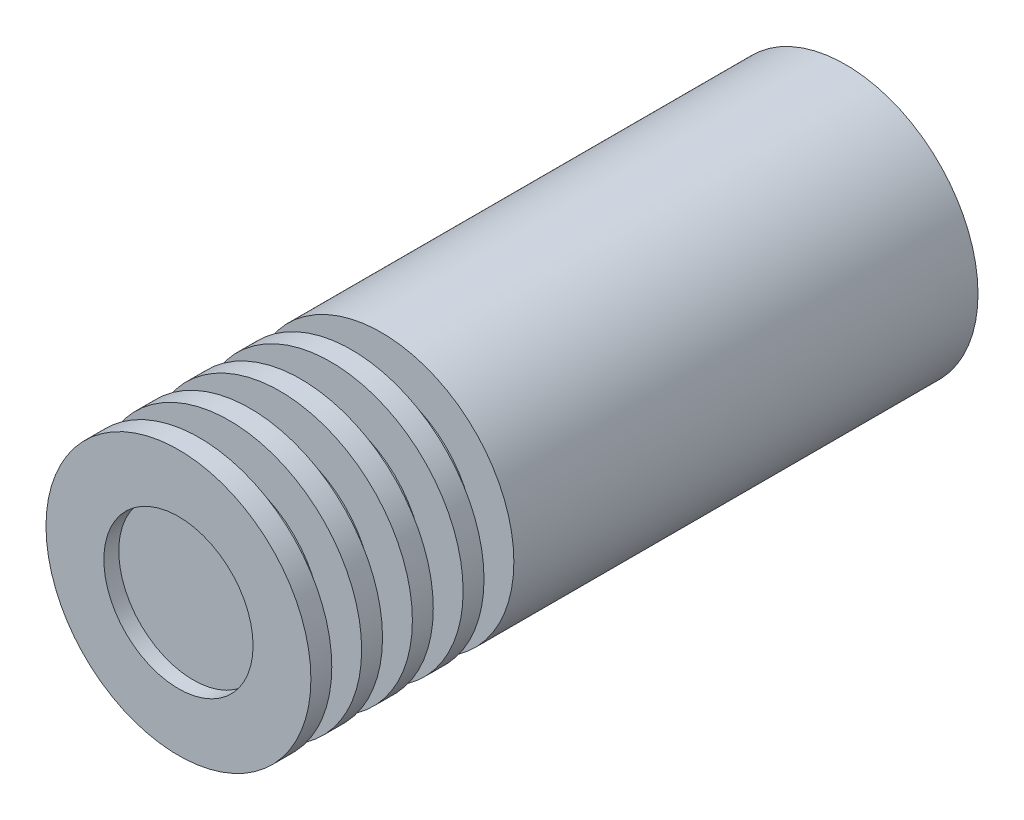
ISO-10303-21;
HEADER;
FILE_DESCRIPTION(('STEP AP214'),'2;1');
FILE_NAME('part.step','',(''),(''),'','','');
FILE_SCHEMA(('AUTOMOTIVE_DESIGN { 1 0 10303 214 1 1 1 1 }'));
ENDSEC;
DATA;
#1=APPLICATION_CONTEXT('core data for automotive mechanical design processes');
#2=APPLICATION_PROTOCOL_DEFINITION('international standard','automotive_design',2000,#1);
#3=PRODUCT_CONTEXT('',#1,'mechanical');
#4=PRODUCT('Part','Part','',(#3));
#5=PRODUCT_RELATED_PRODUCT_CATEGORY('part','',(#4));
#6=PRODUCT_DEFINITION_FORMATION('','',#4);
#7=PRODUCT_DEFINITION_CONTEXT('part definition',#1,'design');
#8=PRODUCT_DEFINITION('design','',#6,#7);
#9=PRODUCT_DEFINITION_SHAPE('','',#8);
#10=(LENGTH_UNIT() NAMED_UNIT(*) SI_UNIT(.MILLI.,.METRE.));
#11=(NAMED_UNIT(*) PLANE_ANGLE_UNIT() SI_UNIT($,.RADIAN.));
#12=(NAMED_UNIT(*) SI_UNIT($,.STERADIAN.) SOLID_ANGLE_UNIT());
#13=UNCERTAINTY_MEASURE_WITH_UNIT(LENGTH_MEASURE(1.E-05),#10,'distance_accuracy_value','');
#14=(GEOMETRIC_REPRESENTATION_CONTEXT(3) GLOBAL_UNCERTAINTY_ASSIGNED_CONTEXT((#13)) GLOBAL_UNIT_ASSIGNED_CONTEXT((#10,
#11,#12)) REPRESENTATION_CONTEXT('',''));
#15=CARTESIAN_POINT('',(0.,0.,0.));
#16=DIRECTION('',(0.,0.,1.));
#17=DIRECTION('',(1.,0.,0.));
#18=AXIS2_PLACEMENT_3D('',#15,#16,#17);
#19=CARTESIAN_POINT('',(0.,0.,44.7));
#20=DIRECTION('',(0.,0.,-1.));
#21=DIRECTION('',(-1.,0.,0.));
#22=AXIS2_PLACEMENT_3D('',#19,#20,#21);
#23=CYLINDRICAL_SURFACE('',#22,8.875);
#24=CARTESIAN_POINT('',(0.,0.,44.7));
#25=DIRECTION('',(0.,0.,1.));
#26=DIRECTION('',(1.,0.,0.));
#27=AXIS2_PLACEMENT_3D('',#24,#25,#26);
#28=CIRCLE('',#27,8.875);
#29=CARTESIAN_POINT('',(-8.875,0.,44.7));
#30=VERTEX_POINT('',#29);
#31=EDGE_CURVE('E10',#30,#30,#28,.T.);
#32=CARTESIAN_POINT('',(0.,0.,43.3));
#33=DIRECTION('',(0.,0.,1.));
#34=DIRECTION('',(1.,0.,0.));
#35=AXIS2_PLACEMENT_3D('',#32,#33,#34);
#36=CIRCLE('',#35,8.875);
#37=CARTESIAN_POINT('',(-8.875,0.,43.3));
#38=VERTEX_POINT('',#37);
#39=EDGE_CURVE('E89',#38,#38,#36,.T.);
#40=CARTESIAN_POINT('',(-8.875,0.,44.7));
#41=CARTESIAN_POINT('',(-8.875,0.,44.6854166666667));
#42=CARTESIAN_POINT('',(-8.875,0.,44.6708333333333));
#43=CARTESIAN_POINT('',(-8.875,0.,44.6416666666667));
#44=CARTESIAN_POINT('',(-8.875,0.,44.6270833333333));
#45=CARTESIAN_POINT('',(-8.875,0.,44.5979166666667));
#46=CARTESIAN_POINT('',(-8.875,0.,44.5833333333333));
#47=CARTESIAN_POINT('',(-8.875,0.,44.5541666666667));
#48=CARTESIAN_POINT('',(-8.875,0.,44.5395833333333));
#49=CARTESIAN_POINT('',(-8.875,0.,44.5104166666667));
#50=CARTESIAN_POINT('',(-8.875,0.,44.4958333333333));
#51=CARTESIAN_POINT('',(-8.875,0.,44.4666666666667));
#52=CARTESIAN_POINT('',(-8.875,0.,44.4520833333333));
#53=CARTESIAN_POINT('',(-8.875,0.,44.4229166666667));
#54=CARTESIAN_POINT('',(-8.875,0.,44.4083333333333));
#55=CARTESIAN_POINT('',(-8.875,0.,44.3791666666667));
#56=CARTESIAN_POINT('',(-8.875,0.,44.3645833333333));
#57=CARTESIAN_POINT('',(-8.875,0.,44.3354166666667));
#58=CARTESIAN_POINT('',(-8.875,0.,44.3208333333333));
#59=CARTESIAN_POINT('',(-8.875,0.,44.2916666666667));
#60=CARTESIAN_POINT('',(-8.875,0.,44.2770833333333));
#61=CARTESIAN_POINT('',(-8.875,0.,44.2479166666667));
#62=CARTESIAN_POINT('',(-8.875,0.,44.2333333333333));
#63=CARTESIAN_POINT('',(-8.875,0.,44.2041666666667));
#64=CARTESIAN_POINT('',(-8.875,0.,44.1895833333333));
#65=CARTESIAN_POINT('',(-8.875,0.,44.1604166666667));
#66=CARTESIAN_POINT('',(-8.875,0.,44.1458333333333));
#67=CARTESIAN_POINT('',(-8.875,0.,44.1166666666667));
#68=CARTESIAN_POINT('',(-8.875,0.,44.1020833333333));
#69=CARTESIAN_POINT('',(-8.875,0.,44.0729166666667));
#70=CARTESIAN_POINT('',(-8.875,0.,44.0583333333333));
#71=CARTESIAN_POINT('',(-8.875,0.,44.0291666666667));
#72=CARTESIAN_POINT('',(-8.875,0.,44.0145833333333));
#73=CARTESIAN_POINT('',(-8.875,0.,43.9854166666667));
#74=CARTESIAN_POINT('',(-8.875,0.,43.9708333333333));
#75=CARTESIAN_POINT('',(-8.875,0.,43.9416666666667));
#76=CARTESIAN_POINT('',(-8.875,0.,43.9270833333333));
#77=CARTESIAN_POINT('',(-8.875,0.,43.8979166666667));
#78=CARTESIAN_POINT('',(-8.875,0.,43.8833333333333));
#79=CARTESIAN_POINT('',(-8.875,0.,43.8541666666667));
#80=CARTESIAN_POINT('',(-8.875,0.,43.8395833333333));
#81=CARTESIAN_POINT('',(-8.875,0.,43.8104166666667));
#82=CARTESIAN_POINT('',(-8.875,0.,43.7958333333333));
#83=CARTESIAN_POINT('',(-8.875,0.,43.7666666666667));
#84=CARTESIAN_POINT('',(-8.875,0.,43.7520833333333));
#85=CARTESIAN_POINT('',(-8.875,0.,43.7229166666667));
#86=CARTESIAN_POINT('',(-8.875,0.,43.7083333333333));
#87=CARTESIAN_POINT('',(-8.875,0.,43.6791666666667));
#88=CARTESIAN_POINT('',(-8.875,0.,43.6645833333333));
#89=CARTESIAN_POINT('',(-8.875,0.,43.6354166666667));
#90=CARTESIAN_POINT('',(-8.875,0.,43.6208333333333));
#91=CARTESIAN_POINT('',(-8.875,0.,43.5916666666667));
#92=CARTESIAN_POINT('',(-8.875,0.,43.5770833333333));
#93=CARTESIAN_POINT('',(-8.875,0.,43.5479166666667));
#94=CARTESIAN_POINT('',(-8.875,0.,43.5333333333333));
#95=CARTESIAN_POINT('',(-8.875,0.,43.5041666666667));
#96=CARTESIAN_POINT('',(-8.875,0.,43.4895833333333));
#97=CARTESIAN_POINT('',(-8.875,0.,43.4604166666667));
#98=CARTESIAN_POINT('',(-8.875,0.,43.4458333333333));
#99=CARTESIAN_POINT('',(-8.875,0.,43.4166666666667));
#100=CARTESIAN_POINT('',(-8.875,0.,43.4020833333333));
#101=CARTESIAN_POINT('',(-8.875,0.,43.3729166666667));
#102=CARTESIAN_POINT('',(-8.875,0.,43.3583333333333));
#103=CARTESIAN_POINT('',(-8.875,0.,43.3291666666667));
#104=CARTESIAN_POINT('',(-8.875,0.,43.3145833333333));
#105=CARTESIAN_POINT('',(-8.875,0.,43.3));
#106=B_SPLINE_CURVE_WITH_KNOTS('',3,(#40,#41,#42,#43,#44,#45,#46,#47,#48,#49,#50,#51,#52,#53,
#54,#55,#56,#57,#58,#59,#60,#61,#62,#63,#64,#65,#66,#67,#68,#69,#70,#71,#72,#73,#74,#75,#76,#77,
#78,#79,#80,#81,#82,#83,#84,#85,#86,#87,#88,#89,#90,#91,#92,#93,#94,#95,#96,#97,#98,#99,#100,
#101,#102,#103,#104,#105),.UNSPECIFIED.,.F.,.F.,(4,2,2,2,2,2,2,2,2,2,2,2,2,2,2,2,2,2,2,2,2,2,2,
2,2,2,2,2,2,2,2,2,4),(0.,0.0437500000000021,0.0875000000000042,0.131250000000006,
0.175000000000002,0.218750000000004,0.262500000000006,0.306250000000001,0.350000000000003,
0.393750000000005,0.4375,0.481250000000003,0.525000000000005,0.56875,0.612500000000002,
0.656250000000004,0.700000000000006,0.743750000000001,0.787500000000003,0.831250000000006,
0.875000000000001,0.918750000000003,0.962500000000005,1.00625,1.05,1.09375,1.1375,1.18125,1.225,
1.26875,1.3125,1.35625,1.40000000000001),.UNSPECIFIED.);
#107=EDGE_CURVE('BSEAM37',#30,#38,#106,.T.);
#108=ORIENTED_EDGE('',*,*,#31,.F.);
#109=ORIENTED_EDGE('',*,*,#39,.T.);
#110=ORIENTED_EDGE('',*,*,#107,.T.);
#111=ORIENTED_EDGE('',*,*,#107,.F.);
#112=EDGE_LOOP('',(#108,#110,#109,#111));
#113=FACE_BOUND('',#112,.T.);
#114=ADVANCED_FACE('F37',(#113),#23,.T.);
#115=CARTESIAN_POINT('',(0.,0.,44.7));
#116=DIRECTION('',(0.,0.,1.));
#117=DIRECTION('',(1.,0.,0.));
#118=AXIS2_PLACEMENT_3D('',#115,#116,#117);
#119=PLANE('',#118);
#120=CARTESIAN_POINT('',(0.,0.,44.7));
#121=DIRECTION('',(0.,0.,1.));
#122=DIRECTION('',(1.,0.,0.));
#123=AXIS2_PLACEMENT_3D('',#120,#121,#122);
#124=CIRCLE('',#123,5.);
#125=CARTESIAN_POINT('',(5.,0.,44.7));
#126=VERTEX_POINT('',#125);
#127=EDGE_CURVE('E115',#126,#126,#124,.T.);
#128=ORIENTED_EDGE('',*,*,#127,.F.);
#129=EDGE_LOOP('',(#128));
#130=FACE_BOUND('',#129,.T.);
#131=ORIENTED_EDGE('',*,*,#31,.T.);
#132=EDGE_LOOP('',(#131));
#133=FACE_BOUND('',#132,.T.);
#134=ADVANCED_FACE('F132',(#130,#133),#119,.T.);
#135=CARTESIAN_POINT('',(0.,8.875,43.3));
#136=DIRECTION('',(0.,0.,-1.));
#137=DIRECTION('',(-1.,0.,0.));
#138=AXIS2_PLACEMENT_3D('',#135,#136,#137);
#139=PLANE('',#138);
#140=CARTESIAN_POINT('',(0.,0.,43.3));
#141=DIRECTION('',(0.,0.,1.));
#142=DIRECTION('',(1.,0.,0.));
#143=AXIS2_PLACEMENT_3D('',#140,#141,#142);
#144=CIRCLE('',#143,6.175);
#145=CARTESIAN_POINT('',(6.175,0.,43.3));
#146=VERTEX_POINT('',#145);
#147=EDGE_CURVE('E49',#146,#146,#144,.T.);
#148=ORIENTED_EDGE('',*,*,#147,.T.);
#149=EDGE_LOOP('',(#148));
#150=FACE_BOUND('',#149,.T.);
#151=ORIENTED_EDGE('',*,*,#39,.F.);
#152=EDGE_LOOP('',(#151));
#153=FACE_BOUND('',#152,.T.);
#154=ADVANCED_FACE('F134',(#150,#153),#139,.T.);
#155=CARTESIAN_POINT('',(0.,0.,44.7));
#156=DIRECTION('',(0.,0.,1.));
#157=DIRECTION('',(1.,0.,0.));
#158=AXIS2_PLACEMENT_3D('',#155,#156,#157);
#159=CYLINDRICAL_SURFACE('',#158,6.175);
#160=CARTESIAN_POINT('',(0.,0.,41.3));
#161=DIRECTION('',(0.,0.,1.));
#162=DIRECTION('',(1.,0.,0.));
#163=AXIS2_PLACEMENT_3D('',#160,#161,#162);
#164=CIRCLE('',#163,6.175);
#165=CARTESIAN_POINT('',(6.175,0.,41.3));
#166=VERTEX_POINT('',#165);
#167=EDGE_CURVE('E104',#166,#166,#164,.T.);
#168=ORIENTED_EDGE('',*,*,#167,.T.);
#169=EDGE_LOOP('',(#168));
#170=FACE_BOUND('',#169,.T.);
#171=ORIENTED_EDGE('',*,*,#147,.F.);
#172=EDGE_LOOP('',(#171));
#173=FACE_BOUND('',#172,.T.);
#174=ADVANCED_FACE('F140',(#170,#173),#159,.T.);
#175=CARTESIAN_POINT('',(0.,8.875,41.3));
#176=DIRECTION('',(0.,0.,1.));
#177=DIRECTION('',(1.,0.,0.));
#178=AXIS2_PLACEMENT_3D('',#175,#176,#177);
#179=PLANE('',#178);
#180=CARTESIAN_POINT('',(0.,0.,41.3));
#181=DIRECTION('',(0.,0.,1.));
#182=DIRECTION('',(1.,0.,0.));
#183=AXIS2_PLACEMENT_3D('',#180,#181,#182);
#184=CIRCLE('',#183,8.875);
#185=CARTESIAN_POINT('',(-8.875,0.,41.3));
#186=VERTEX_POINT('',#185);
#187=EDGE_CURVE('E108',#186,#186,#184,.T.);
#188=ORIENTED_EDGE('',*,*,#187,.T.);
#189=EDGE_LOOP('',(#188));
#190=FACE_BOUND('',#189,.T.);
#191=ORIENTED_EDGE('',*,*,#167,.F.);
#192=EDGE_LOOP('',(#191));
#193=FACE_BOUND('',#192,.T.);
#194=ADVANCED_FACE('F222',(#190,#193),#179,.T.);
#195=CARTESIAN_POINT('',(0.,0.,39.9));
#196=DIRECTION('',(0.,0.,1.));
#197=DIRECTION('',(1.,0.,0.));
#198=AXIS2_PLACEMENT_3D('',#195,#196,#197);
#199=CIRCLE('',#198,8.875);
#200=CARTESIAN_POINT('',(-8.875,0.,39.9));
#201=VERTEX_POINT('',#200);
#202=EDGE_CURVE('E73',#201,#201,#199,.T.);
#203=CARTESIAN_POINT('',(-8.875,0.,39.9));
#204=CARTESIAN_POINT('',(-8.875,0.,39.9145833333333));
#205=CARTESIAN_POINT('',(-8.875,0.,39.9291666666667));
#206=CARTESIAN_POINT('',(-8.875,0.,39.9583333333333));
#207=CARTESIAN_POINT('',(-8.875,0.,39.9729166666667));
#208=CARTESIAN_POINT('',(-8.875,0.,40.0020833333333));
#209=CARTESIAN_POINT('',(-8.875,0.,40.0166666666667));
#210=CARTESIAN_POINT('',(-8.875,0.,40.0458333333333));
#211=CARTESIAN_POINT('',(-8.875,0.,40.0604166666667));
#212=CARTESIAN_POINT('',(-8.875,0.,40.0895833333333));
#213=CARTESIAN_POINT('',(-8.875,0.,40.1041666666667));
#214=CARTESIAN_POINT('',(-8.875,0.,40.1333333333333));
#215=CARTESIAN_POINT('',(-8.875,0.,40.1479166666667));
#216=CARTESIAN_POINT('',(-8.875,0.,40.1770833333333));
#217=CARTESIAN_POINT('',(-8.875,0.,40.1916666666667));
#218=CARTESIAN_POINT('',(-8.875,0.,40.2208333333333));
#219=CARTESIAN_POINT('',(-8.875,0.,40.2354166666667));
#220=CARTESIAN_POINT('',(-8.875,0.,40.2645833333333));
#221=CARTESIAN_POINT('',(-8.875,0.,40.2791666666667));
#222=CARTESIAN_POINT('',(-8.875,0.,40.3083333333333));
#223=CARTESIAN_POINT('',(-8.875,0.,40.3229166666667));
#224=CARTESIAN_POINT('',(-8.875,0.,40.3520833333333));
#225=CARTESIAN_POINT('',(-8.875,0.,40.3666666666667));
#226=CARTESIAN_POINT('',(-8.875,0.,40.3958333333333));
#227=CARTESIAN_POINT('',(-8.875,0.,40.4104166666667));
#228=CARTESIAN_POINT('',(-8.875,0.,40.4395833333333));
#229=CARTESIAN_POINT('',(-8.875,0.,40.4541666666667));
#230=CARTESIAN_POINT('',(-8.875,0.,40.4833333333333));
#231=CARTESIAN_POINT('',(-8.875,0.,40.4979166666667));
#232=CARTESIAN_POINT('',(-8.875,0.,40.5270833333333));
#233=CARTESIAN_POINT('',(-8.875,0.,40.5416666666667));
#234=CARTESIAN_POINT('',(-8.875,0.,40.5708333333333));
#235=CARTESIAN_POINT('',(-8.875,0.,40.5854166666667));
#236=CARTESIAN_POINT('',(-8.875,0.,40.6145833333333));
#237=CARTESIAN_POINT('',(-8.875,0.,40.6291666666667));
#238=CARTESIAN_POINT('',(-8.875,0.,40.6583333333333));
#239=CARTESIAN_POINT('',(-8.875,0.,40.6729166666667));
#240=CARTESIAN_POINT('',(-8.875,0.,40.7020833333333));
#241=CARTESIAN_POINT('',(-8.875,0.,40.7166666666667));
#242=CARTESIAN_POINT('',(-8.875,0.,40.7458333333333));
#243=CARTESIAN_POINT('',(-8.875,0.,40.7604166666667));
#244=CARTESIAN_POINT('',(-8.875,0.,40.7895833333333));
#245=CARTESIAN_POINT('',(-8.875,0.,40.8041666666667));
#246=CARTESIAN_POINT('',(-8.875,0.,40.8333333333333));
#247=CARTESIAN_POINT('',(-8.875,0.,40.8479166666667));
#248=CARTESIAN_POINT('',(-8.875,0.,40.8770833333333));
#249=CARTESIAN_POINT('',(-8.875,0.,40.8916666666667));
#250=CARTESIAN_POINT('',(-8.875,0.,40.9208333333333));
#251=CARTESIAN_POINT('',(-8.875,0.,40.9354166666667));
#252=CARTESIAN_POINT('',(-8.875,0.,40.9645833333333));
#253=CARTESIAN_POINT('',(-8.875,0.,40.9791666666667));
#254=CARTESIAN_POINT('',(-8.875,0.,41.0083333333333));
#255=CARTESIAN_POINT('',(-8.875,0.,41.0229166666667));
#256=CARTESIAN_POINT('',(-8.875,0.,41.0520833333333));
#257=CARTESIAN_POINT('',(-8.875,0.,41.0666666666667));
#258=CARTESIAN_POINT('',(-8.875,0.,41.0958333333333));
#259=CARTESIAN_POINT('',(-8.875,0.,41.1104166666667));
#260=CARTESIAN_POINT('',(-8.875,0.,41.1395833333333));
#261=CARTESIAN_POINT('',(-8.875,0.,41.1541666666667));
#262=CARTESIAN_POINT('',(-8.875,0.,41.1833333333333));
#263=CARTESIAN_POINT('',(-8.875,0.,41.1979166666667));
#264=CARTESIAN_POINT('',(-8.875,0.,41.2270833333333));
#265=CARTESIAN_POINT('',(-8.875,0.,41.2416666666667));
#266=CARTESIAN_POINT('',(-8.875,0.,41.2708333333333));
#267=CARTESIAN_POINT('',(-8.875,0.,41.2854166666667));
#268=CARTESIAN_POINT('',(-8.875,0.,41.3));
#269=B_SPLINE_CURVE_WITH_KNOTS('',3,(#203,#204,#205,#206,#207,#208,#209,#210,#211,#212,#213,
#214,#215,#216,#217,#218,#219,#220,#221,#222,#223,#224,#225,#226,#227,#228,#229,#230,#231,#232,
#233,#234,#235,#236,#237,#238,#239,#240,#241,#242,#243,#244,#245,#246,#247,#248,#249,#250,#251,
#252,#253,#254,#255,#256,#257,#258,#259,#260,#261,#262,#263,#264,#265,#266,#267,#268),
.UNSPECIFIED.,.F.,.F.,(4,2,2,2,2,2,2,2,2,2,2,2,2,2,2,2,2,2,2,2,2,2,2,2,2,2,2,2,2,2,2,2,4),(0.,
0.0437500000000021,0.0875000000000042,0.131250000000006,0.175000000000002,0.218750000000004,
0.262500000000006,0.306250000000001,0.350000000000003,0.393750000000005,0.4375,
0.481250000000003,0.525000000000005,0.56875,0.612500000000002,0.656250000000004,
0.699999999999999,0.743750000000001,0.787500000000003,0.831249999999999,0.875000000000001,
0.918750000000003,0.962500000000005,1.00625,1.05,1.09375,1.1375,1.18125,1.225,1.26875,1.3125,
1.35625,1.4),.UNSPECIFIED.);
#270=EDGE_CURVE('BSEAM144',#201,#186,#269,.T.);
#271=ORIENTED_EDGE('',*,*,#202,.T.);
#272=ORIENTED_EDGE('',*,*,#187,.F.);
#273=ORIENTED_EDGE('',*,*,#270,.T.);
#274=ORIENTED_EDGE('',*,*,#270,.F.);
#275=EDGE_LOOP('',(#271,#273,#272,#274));
#276=FACE_BOUND('',#275,.T.);
#277=ADVANCED_FACE('F144',(#276),#23,.T.);
#278=CARTESIAN_POINT('',(0.,8.875,39.9));
#279=DIRECTION('',(0.,0.,-1.));
#280=DIRECTION('',(-1.,0.,0.));
#281=AXIS2_PLACEMENT_3D('',#278,#279,#280);
#282=PLANE('',#281);
#283=CARTESIAN_POINT('',(0.,0.,39.9));
#284=DIRECTION('',(0.,0.,1.));
#285=DIRECTION('',(1.,0.,0.));
#286=AXIS2_PLACEMENT_3D('',#283,#284,#285);
#287=CIRCLE('',#286,6.175);
#288=CARTESIAN_POINT('',(6.175,0.,39.9));
#289=VERTEX_POINT('',#288);
#290=EDGE_CURVE('E85',#289,#289,#287,.T.);
#291=ORIENTED_EDGE('',*,*,#290,.T.);
#292=EDGE_LOOP('',(#291));
#293=FACE_BOUND('',#292,.T.);
#294=ORIENTED_EDGE('',*,*,#202,.F.);
#295=EDGE_LOOP('',(#294));
#296=FACE_BOUND('',#295,.T.);
#297=ADVANCED_FACE('F211',(#293,#296),#282,.T.);
#298=CARTESIAN_POINT('',(0.,0.,44.7));
#299=DIRECTION('',(0.,0.,1.));
#300=DIRECTION('',(1.,0.,0.));
#301=AXIS2_PLACEMENT_3D('',#298,#299,#300);
#302=CYLINDRICAL_SURFACE('',#301,6.175);
#303=CARTESIAN_POINT('',(0.,0.,37.9));
#304=DIRECTION('',(0.,0.,1.));
#305=DIRECTION('',(1.,0.,0.));
#306=AXIS2_PLACEMENT_3D('',#303,#304,#305);
#307=CIRCLE('',#306,6.175);
#308=CARTESIAN_POINT('',(6.175,0.,37.9));
#309=VERTEX_POINT('',#308);
#310=EDGE_CURVE('E90',#309,#309,#307,.T.);
#311=ORIENTED_EDGE('',*,*,#310,.T.);
#312=EDGE_LOOP('',(#311));
#313=FACE_BOUND('',#312,.T.);
#314=ORIENTED_EDGE('',*,*,#290,.F.);
#315=EDGE_LOOP('',(#314));
#316=FACE_BOUND('',#315,.T.);
#317=ADVANCED_FACE('F205',(#313,#316),#302,.T.);
#318=CARTESIAN_POINT('',(0.,8.875,37.9));
#319=DIRECTION('',(0.,0.,1.));
#320=DIRECTION('',(1.,0.,0.));
#321=AXIS2_PLACEMENT_3D('',#318,#319,#320);
#322=PLANE('',#321);
#323=CARTESIAN_POINT('',(0.,0.,37.9));
#324=DIRECTION('',(0.,0.,1.));
#325=DIRECTION('',(1.,0.,0.));
#326=AXIS2_PLACEMENT_3D('',#323,#324,#325);
#327=CIRCLE('',#326,8.875);
#328=CARTESIAN_POINT('',(-8.875,0.,37.9));
#329=VERTEX_POINT('',#328);
#330=EDGE_CURVE('E94',#329,#329,#327,.T.);
#331=ORIENTED_EDGE('',*,*,#330,.T.);
#332=EDGE_LOOP('',(#331));
#333=FACE_BOUND('',#332,.T.);
#334=ORIENTED_EDGE('',*,*,#310,.F.);
#335=EDGE_LOOP('',(#334));
#336=FACE_BOUND('',#335,.T.);
#337=ADVANCED_FACE('F200',(#333,#336),#322,.T.);
#338=CARTESIAN_POINT('',(0.,0.,36.5));
#339=DIRECTION('',(0.,0.,1.));
#340=DIRECTION('',(1.,0.,0.));
#341=AXIS2_PLACEMENT_3D('',#338,#339,#340);
#342=CIRCLE('',#341,8.87499999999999);
#343=CARTESIAN_POINT('',(-8.875,0.,36.5));
#344=VERTEX_POINT('',#343);
#345=EDGE_CURVE('E55',#344,#344,#342,.T.);
#346=CARTESIAN_POINT('',(-8.875,0.,36.5));
#347=CARTESIAN_POINT('',(-8.875,0.,36.5145833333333));
#348=CARTESIAN_POINT('',(-8.875,0.,36.5291666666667));
#349=CARTESIAN_POINT('',(-8.875,0.,36.5583333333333));
#350=CARTESIAN_POINT('',(-8.875,0.,36.5729166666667));
#351=CARTESIAN_POINT('',(-8.875,0.,36.6020833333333));
#352=CARTESIAN_POINT('',(-8.875,0.,36.6166666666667));
#353=CARTESIAN_POINT('',(-8.875,0.,36.6458333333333));
#354=CARTESIAN_POINT('',(-8.875,0.,36.6604166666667));
#355=CARTESIAN_POINT('',(-8.875,0.,36.6895833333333));
#356=CARTESIAN_POINT('',(-8.875,0.,36.7041666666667));
#357=CARTESIAN_POINT('',(-8.875,0.,36.7333333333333));
#358=CARTESIAN_POINT('',(-8.875,0.,36.7479166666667));
#359=CARTESIAN_POINT('',(-8.875,0.,36.7770833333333));
#360=CARTESIAN_POINT('',(-8.875,0.,36.7916666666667));
#361=CARTESIAN_POINT('',(-8.875,0.,36.8208333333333));
#362=CARTESIAN_POINT('',(-8.875,0.,36.8354166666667));
#363=CARTESIAN_POINT('',(-8.875,0.,36.8645833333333));
#364=CARTESIAN_POINT('',(-8.875,0.,36.8791666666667));
#365=CARTESIAN_POINT('',(-8.875,0.,36.9083333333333));
#366=CARTESIAN_POINT('',(-8.875,0.,36.9229166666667));
#367=CARTESIAN_POINT('',(-8.875,0.,36.9520833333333));
#368=CARTESIAN_POINT('',(-8.875,0.,36.9666666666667));
#369=CARTESIAN_POINT('',(-8.875,0.,36.9958333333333));
#370=CARTESIAN_POINT('',(-8.875,0.,37.0104166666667));
#371=CARTESIAN_POINT('',(-8.875,0.,37.0395833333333));
#372=CARTESIAN_POINT('',(-8.875,0.,37.0541666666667));
#373=CARTESIAN_POINT('',(-8.875,0.,37.0833333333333));
#374=CARTESIAN_POINT('',(-8.875,0.,37.0979166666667));
#375=CARTESIAN_POINT('',(-8.875,0.,37.1270833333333));
#376=CARTESIAN_POINT('',(-8.875,0.,37.1416666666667));
#377=CARTESIAN_POINT('',(-8.875,0.,37.1708333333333));
#378=CARTESIAN_POINT('',(-8.875,0.,37.1854166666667));
#379=CARTESIAN_POINT('',(-8.875,0.,37.2145833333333));
#380=CARTESIAN_POINT('',(-8.875,0.,37.2291666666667));
#381=CARTESIAN_POINT('',(-8.875,0.,37.2583333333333));
#382=CARTESIAN_POINT('',(-8.875,0.,37.2729166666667));
#383=CARTESIAN_POINT('',(-8.875,0.,37.3020833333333));
#384=CARTESIAN_POINT('',(-8.875,0.,37.3166666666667));
#385=CARTESIAN_POINT('',(-8.875,0.,37.3458333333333));
#386=CARTESIAN_POINT('',(-8.875,0.,37.3604166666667));
#387=CARTESIAN_POINT('',(-8.875,0.,37.3895833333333));
#388=CARTESIAN_POINT('',(-8.875,0.,37.4041666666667));
#389=CARTESIAN_POINT('',(-8.875,0.,37.4333333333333));
#390=CARTESIAN_POINT('',(-8.875,0.,37.4479166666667));
#391=CARTESIAN_POINT('',(-8.875,0.,37.4770833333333));
#392=CARTESIAN_POINT('',(-8.875,0.,37.4916666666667));
#393=CARTESIAN_POINT('',(-8.875,0.,37.5208333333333));
#394=CARTESIAN_POINT('',(-8.875,0.,37.5354166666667));
#395=CARTESIAN_POINT('',(-8.875,0.,37.5645833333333));
#396=CARTESIAN_POINT('',(-8.875,0.,37.5791666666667));
#397=CARTESIAN_POINT('',(-8.875,0.,37.6083333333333));
#398=CARTESIAN_POINT('',(-8.875,0.,37.6229166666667));
#399=CARTESIAN_POINT('',(-8.875,0.,37.6520833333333));
#400=CARTESIAN_POINT('',(-8.875,0.,37.6666666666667));
#401=CARTESIAN_POINT('',(-8.875,0.,37.6958333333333));
#402=CARTESIAN_POINT('',(-8.875,0.,37.7104166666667));
#403=CARTESIAN_POINT('',(-8.875,0.,37.7395833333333));
#404=CARTESIAN_POINT('',(-8.875,0.,37.7541666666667));
#405=CARTESIAN_POINT('',(-8.875,0.,37.7833333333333));
#406=CARTESIAN_POINT('',(-8.875,0.,37.7979166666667));
#407=CARTESIAN_POINT('',(-8.875,0.,37.8270833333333));
#408=CARTESIAN_POINT('',(-8.875,0.,37.8416666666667));
#409=CARTESIAN_POINT('',(-8.875,0.,37.8708333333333));
#410=CARTESIAN_POINT('',(-8.875,0.,37.8854166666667));
#411=CARTESIAN_POINT('',(-8.875,0.,37.9));
#412=B_SPLINE_CURVE_WITH_KNOTS('',3,(#346,#347,#348,#349,#350,#351,#352,#353,#354,#355,#356,
#357,#358,#359,#360,#361,#362,#363,#364,#365,#366,#367,#368,#369,#370,#371,#372,#373,#374,#375,
#376,#377,#378,#379,#380,#381,#382,#383,#384,#385,#386,#387,#388,#389,#390,#391,#392,#393,#394,
#395,#396,#397,#398,#399,#400,#401,#402,#403,#404,#405,#406,#407,#408,#409,#410,#411),
.UNSPECIFIED.,.F.,.F.,(4,2,2,2,2,2,2,2,2,2,2,2,2,2,2,2,2,2,2,2,2,2,2,2,2,2,2,2,2,2,2,2,4),(0.,
0.0437500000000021,0.0875000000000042,0.131249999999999,0.175000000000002,0.218750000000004,
0.262500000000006,0.306250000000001,0.350000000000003,0.393749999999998,0.4375,
0.481250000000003,0.525000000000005,0.56875,0.612500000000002,0.656250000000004,
0.699999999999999,0.743750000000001,0.787500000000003,0.831249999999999,0.875000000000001,
0.918750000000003,0.962499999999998,1.00625,1.05,1.09375,1.1375,1.18125,1.225,1.26875,1.3125,
1.35625,1.4),.UNSPECIFIED.);
#413=EDGE_CURVE('BSEAM178',#344,#329,#412,.T.);
#414=ORIENTED_EDGE('',*,*,#345,.T.);
#415=ORIENTED_EDGE('',*,*,#330,.F.);
#416=ORIENTED_EDGE('',*,*,#413,.T.);
#417=ORIENTED_EDGE('',*,*,#413,.F.);
#418=EDGE_LOOP('',(#414,#416,#415,#417));
#419=FACE_BOUND('',#418,.T.);
#420=ADVANCED_FACE('F178',(#419),#23,.T.);
#421=CARTESIAN_POINT('',(0.,8.87499999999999,36.5));
#422=DIRECTION('',(0.,0.,-1.));
#423=DIRECTION('',(-1.,0.,0.));
#424=AXIS2_PLACEMENT_3D('',#421,#422,#423);
#425=PLANE('',#424);
#426=CARTESIAN_POINT('',(0.,0.,36.5));
#427=DIRECTION('',(0.,0.,1.));
#428=DIRECTION('',(1.,0.,0.));
#429=AXIS2_PLACEMENT_3D('',#426,#427,#428);
#430=CIRCLE('',#429,6.175);
#431=CARTESIAN_POINT('',(6.175,0.,36.5));
#432=VERTEX_POINT('',#431);
#433=EDGE_CURVE('E69',#432,#432,#430,.T.);
#434=ORIENTED_EDGE('',*,*,#433,.T.);
#435=EDGE_LOOP('',(#434));
#436=FACE_BOUND('',#435,.T.);
#437=ORIENTED_EDGE('',*,*,#345,.F.);
#438=EDGE_LOOP('',(#437));
#439=FACE_BOUND('',#438,.T.);
#440=ADVANCED_FACE('F189',(#436,#439),#425,.T.);
#441=CARTESIAN_POINT('',(0.,0.,44.7));
#442=DIRECTION('',(0.,0.,1.));
#443=DIRECTION('',(1.,0.,0.));
#444=AXIS2_PLACEMENT_3D('',#441,#442,#443);
#445=CYLINDRICAL_SURFACE('',#444,6.175);
#446=CARTESIAN_POINT('',(0.,0.,34.5));
#447=DIRECTION('',(0.,0.,1.));
#448=DIRECTION('',(1.,0.,0.));
#449=AXIS2_PLACEMENT_3D('',#446,#447,#448);
#450=CIRCLE('',#449,6.175);
#451=CARTESIAN_POINT('',(6.175,0.,34.5));
#452=VERTEX_POINT('',#451);
#453=EDGE_CURVE('E74',#452,#452,#450,.T.);
#454=ORIENTED_EDGE('',*,*,#453,.T.);
#455=EDGE_LOOP('',(#454));
#456=FACE_BOUND('',#455,.T.);
#457=ORIENTED_EDGE('',*,*,#433,.F.);
#458=EDGE_LOOP('',(#457));
#459=FACE_BOUND('',#458,.T.);
#460=ADVANCED_FACE('F183',(#456,#459),#445,.T.);
#461=CARTESIAN_POINT('',(0.,8.87499999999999,34.5));
#462=DIRECTION('',(0.,0.,1.));
#463=DIRECTION('',(1.,0.,0.));
#464=AXIS2_PLACEMENT_3D('',#461,#462,#463);
#465=PLANE('',#464);
#466=CARTESIAN_POINT('',(0.,0.,34.5));
#467=DIRECTION('',(0.,0.,1.));
#468=DIRECTION('',(1.,0.,0.));
#469=AXIS2_PLACEMENT_3D('',#466,#467,#468);
#470=CIRCLE('',#469,8.87499999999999);
#471=CARTESIAN_POINT('',(-8.875,0.,34.5));
#472=VERTEX_POINT('',#471);
#473=EDGE_CURVE('E78',#472,#472,#470,.T.);
#474=ORIENTED_EDGE('',*,*,#473,.T.);
#475=EDGE_LOOP('',(#474));
#476=FACE_BOUND('',#475,.T.);
#477=ORIENTED_EDGE('',*,*,#453,.F.);
#478=EDGE_LOOP('',(#477));
#479=FACE_BOUND('',#478,.T.);
#480=ADVANCED_FACE('F177',(#476,#479),#465,.T.);
#481=CARTESIAN_POINT('',(0.,0.,33.1));
#482=DIRECTION('',(0.,0.,1.));
#483=DIRECTION('',(1.,0.,0.));
#484=AXIS2_PLACEMENT_3D('',#481,#482,#483);
#485=CIRCLE('',#484,8.875);
#486=CARTESIAN_POINT('',(-8.875,0.,33.1));
#487=VERTEX_POINT('',#486);
#488=EDGE_CURVE('E64',#487,#487,#485,.T.);
#489=CARTESIAN_POINT('',(-8.875,0.,33.1));
#490=CARTESIAN_POINT('',(-8.875,0.,33.1145833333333));
#491=CARTESIAN_POINT('',(-8.875,0.,33.1291666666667));
#492=CARTESIAN_POINT('',(-8.875,0.,33.1583333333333));
#493=CARTESIAN_POINT('',(-8.875,0.,33.1729166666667));
#494=CARTESIAN_POINT('',(-8.875,0.,33.2020833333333));
#495=CARTESIAN_POINT('',(-8.875,0.,33.2166666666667));
#496=CARTESIAN_POINT('',(-8.875,0.,33.2458333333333));
#497=CARTESIAN_POINT('',(-8.875,0.,33.2604166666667));
#498=CARTESIAN_POINT('',(-8.875,0.,33.2895833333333));
#499=CARTESIAN_POINT('',(-8.875,0.,33.3041666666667));
#500=CARTESIAN_POINT('',(-8.875,0.,33.3333333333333));
#501=CARTESIAN_POINT('',(-8.875,0.,33.3479166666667));
#502=CARTESIAN_POINT('',(-8.875,0.,33.3770833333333));
#503=CARTESIAN_POINT('',(-8.875,0.,33.3916666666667));
#504=CARTESIAN_POINT('',(-8.875,0.,33.4208333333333));
#505=CARTESIAN_POINT('',(-8.875,0.,33.4354166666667));
#506=CARTESIAN_POINT('',(-8.875,0.,33.4645833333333));
#507=CARTESIAN_POINT('',(-8.875,0.,33.4791666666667));
#508=CARTESIAN_POINT('',(-8.875,0.,33.5083333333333));
#509=CARTESIAN_POINT('',(-8.875,0.,33.5229166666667));
#510=CARTESIAN_POINT('',(-8.875,0.,33.5520833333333));
#511=CARTESIAN_POINT('',(-8.875,0.,33.5666666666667));
#512=CARTESIAN_POINT('',(-8.875,0.,33.5958333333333));
#513=CARTESIAN_POINT('',(-8.875,0.,33.6104166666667));
#514=CARTESIAN_POINT('',(-8.875,0.,33.6395833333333));
#515=CARTESIAN_POINT('',(-8.875,0.,33.6541666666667));
#516=CARTESIAN_POINT('',(-8.875,0.,33.6833333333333));
#517=CARTESIAN_POINT('',(-8.875,0.,33.6979166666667));
#518=CARTESIAN_POINT('',(-8.875,0.,33.7270833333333));
#519=CARTESIAN_POINT('',(-8.875,0.,33.7416666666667));
#520=CARTESIAN_POINT('',(-8.875,0.,33.7708333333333));
#521=CARTESIAN_POINT('',(-8.875,0.,33.7854166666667));
#522=CARTESIAN_POINT('',(-8.875,0.,33.8145833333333));
#523=CARTESIAN_POINT('',(-8.875,0.,33.8291666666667));
#524=CARTESIAN_POINT('',(-8.875,0.,33.8583333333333));
#525=CARTESIAN_POINT('',(-8.875,0.,33.8729166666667));
#526=CARTESIAN_POINT('',(-8.875,0.,33.9020833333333));
#527=CARTESIAN_POINT('',(-8.875,0.,33.9166666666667));
#528=CARTESIAN_POINT('',(-8.875,0.,33.9458333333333));
#529=CARTESIAN_POINT('',(-8.875,0.,33.9604166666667));
#530=CARTESIAN_POINT('',(-8.875,0.,33.9895833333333));
#531=CARTESIAN_POINT('',(-8.875,0.,34.0041666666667));
#532=CARTESIAN_POINT('',(-8.875,0.,34.0333333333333));
#533=CARTESIAN_POINT('',(-8.875,0.,34.0479166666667));
#534=CARTESIAN_POINT('',(-8.875,0.,34.0770833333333));
#535=CARTESIAN_POINT('',(-8.875,0.,34.0916666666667));
#536=CARTESIAN_POINT('',(-8.875,0.,34.1208333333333));
#537=CARTESIAN_POINT('',(-8.875,0.,34.1354166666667));
#538=CARTESIAN_POINT('',(-8.875,0.,34.1645833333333));
#539=CARTESIAN_POINT('',(-8.875,0.,34.1791666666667));
#540=CARTESIAN_POINT('',(-8.875,0.,34.2083333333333));
#541=CARTESIAN_POINT('',(-8.875,0.,34.2229166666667));
#542=CARTESIAN_POINT('',(-8.875,0.,34.2520833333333));
#543=CARTESIAN_POINT('',(-8.875,0.,34.2666666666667));
#544=CARTESIAN_POINT('',(-8.875,0.,34.2958333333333));
#545=CARTESIAN_POINT('',(-8.875,0.,34.3104166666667));
#546=CARTESIAN_POINT('',(-8.875,0.,34.3395833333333));
#547=CARTESIAN_POINT('',(-8.875,0.,34.3541666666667));
#548=CARTESIAN_POINT('',(-8.875,0.,34.3833333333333));
#549=CARTESIAN_POINT('',(-8.875,0.,34.3979166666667));
#550=CARTESIAN_POINT('',(-8.875,0.,34.4270833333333));
#551=CARTESIAN_POINT('',(-8.875,0.,34.4416666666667));
#552=CARTESIAN_POINT('',(-8.875,0.,34.4708333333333));
#553=CARTESIAN_POINT('',(-8.875,0.,34.4854166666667));
#554=CARTESIAN_POINT('',(-8.875,0.,34.5));
#555=B_SPLINE_CURVE_WITH_KNOTS('',3,(#489,#490,#491,#492,#493,#494,#495,#496,#497,#498,#499,
#500,#501,#502,#503,#504,#505,#506,#507,#508,#509,#510,#511,#512,#513,#514,#515,#516,#517,#518,
#519,#520,#521,#522,#523,#524,#525,#526,#527,#528,#529,#530,#531,#532,#533,#534,#535,#536,#537,
#538,#539,#540,#541,#542,#543,#544,#545,#546,#547,#548,#549,#550,#551,#552,#553,#554),
.UNSPECIFIED.,.F.,.F.,(4,2,2,2,2,2,2,2,2,2,2,2,2,2,2,2,2,2,2,2,2,2,2,2,2,2,2,2,2,2,2,2,4),(0.,
0.0437500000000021,0.0875000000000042,0.131249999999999,0.175000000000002,0.218750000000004,
0.262499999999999,0.306250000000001,0.350000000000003,0.393750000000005,0.4375,
0.481250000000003,0.525000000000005,0.56875,0.612500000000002,0.656250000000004,
0.699999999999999,0.743750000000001,0.787500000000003,0.831249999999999,0.875000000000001,
0.918750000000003,0.962499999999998,1.00625,1.05,1.09375,1.1375,1.18125,1.225,1.26875,1.3125,
1.35625,1.4),.UNSPECIFIED.);
#556=EDGE_CURVE('BSEAM157',#487,#472,#555,.T.);
#557=ORIENTED_EDGE('',*,*,#488,.T.);
#558=ORIENTED_EDGE('',*,*,#473,.F.);
#559=ORIENTED_EDGE('',*,*,#556,.T.);
#560=ORIENTED_EDGE('',*,*,#556,.F.);
#561=EDGE_LOOP('',(#557,#559,#558,#560));
#562=FACE_BOUND('',#561,.T.);
#563=ADVANCED_FACE('F157',(#562),#23,.T.);
#564=CARTESIAN_POINT('',(0.,8.875,33.1));
#565=DIRECTION('',(0.,0.,-1.));
#566=DIRECTION('',(-1.,0.,0.));
#567=AXIS2_PLACEMENT_3D('',#564,#565,#566);
#568=PLANE('',#567);
#569=CARTESIAN_POINT('',(0.,0.,33.1));
#570=DIRECTION('',(0.,0.,1.));
#571=DIRECTION('',(1.,0.,0.));
#572=AXIS2_PLACEMENT_3D('',#569,#570,#571);
#573=CIRCLE('',#572,6.175);
#574=CARTESIAN_POINT('',(6.175,0.,33.1));
#575=VERTEX_POINT('',#574);
#576=EDGE_CURVE('E51',#575,#575,#573,.T.);
#577=ORIENTED_EDGE('',*,*,#576,.T.);
#578=EDGE_LOOP('',(#577));
#579=FACE_BOUND('',#578,.T.);
#580=ORIENTED_EDGE('',*,*,#488,.F.);
#581=EDGE_LOOP('',(#580));
#582=FACE_BOUND('',#581,.T.);
#583=ADVANCED_FACE('F146',(#579,#582),#568,.T.);
#584=CARTESIAN_POINT('',(0.,0.,44.7));
#585=DIRECTION('',(0.,0.,1.));
#586=DIRECTION('',(1.,0.,0.));
#587=AXIS2_PLACEMENT_3D('',#584,#585,#586);
#588=CYLINDRICAL_SURFACE('',#587,6.175);
#589=CARTESIAN_POINT('',(0.,0.,31.1));
#590=DIRECTION('',(0.,0.,1.));
#591=DIRECTION('',(1.,0.,0.));
#592=AXIS2_PLACEMENT_3D('',#589,#590,#591);
#593=CIRCLE('',#592,6.175);
#594=CARTESIAN_POINT('',(6.175,0.,31.1));
#595=VERTEX_POINT('',#594);
#596=EDGE_CURVE('E56',#595,#595,#593,.T.);
#597=ORIENTED_EDGE('',*,*,#596,.T.);
#598=EDGE_LOOP('',(#597));
#599=FACE_BOUND('',#598,.T.);
#600=ORIENTED_EDGE('',*,*,#576,.F.);
#601=EDGE_LOOP('',(#600));
#602=FACE_BOUND('',#601,.T.);
#603=ADVANCED_FACE('F158',(#599,#602),#588,.T.);
#604=CARTESIAN_POINT('',(0.,8.875,31.1));
#605=DIRECTION('',(0.,0.,1.));
#606=DIRECTION('',(1.,0.,0.));
#607=AXIS2_PLACEMENT_3D('',#604,#605,#606);
#608=PLANE('',#607);
#609=CARTESIAN_POINT('',(0.,0.,31.1));
#610=DIRECTION('',(0.,0.,1.));
#611=DIRECTION('',(1.,0.,0.));
#612=AXIS2_PLACEMENT_3D('',#609,#610,#611);
#613=CIRCLE('',#612,8.875);
#614=CARTESIAN_POINT('',(-8.875,0.,31.1));
#615=VERTEX_POINT('',#614);
#616=EDGE_CURVE('E60',#615,#615,#613,.T.);
#617=ORIENTED_EDGE('',*,*,#616,.T.);
#618=EDGE_LOOP('',(#617));
#619=FACE_BOUND('',#618,.T.);
#620=ORIENTED_EDGE('',*,*,#596,.F.);
#621=EDGE_LOOP('',(#620));
#622=FACE_BOUND('',#621,.T.);
#623=ADVANCED_FACE('F150',(#619,#622),#608,.T.);
#624=CARTESIAN_POINT('',(0.,0.,0.));
#625=DIRECTION('',(0.,0.,1.));
#626=DIRECTION('',(1.,0.,0.));
#627=AXIS2_PLACEMENT_3D('',#624,#625,#626);
#628=PLANE('',#627);
#629=CARTESIAN_POINT('',(0.,0.,0.));
#630=DIRECTION('',(0.,0.,1.));
#631=DIRECTION('',(1.,0.,0.));
#632=AXIS2_PLACEMENT_3D('',#629,#630,#631);
#633=CIRCLE('',#632,8.875);
#634=CARTESIAN_POINT('',(-8.875,0.,0.));
#635=VERTEX_POINT('',#634);
#636=EDGE_CURVE('E40',#635,#635,#633,.T.);
#637=ORIENTED_EDGE('',*,*,#636,.F.);
#638=EDGE_LOOP('',(#637));
#639=FACE_BOUND('',#638,.T.);
#640=ADVANCED_FACE('F148',(#639),#628,.F.);
#641=CARTESIAN_POINT('',(-8.875,0.,0.));
#642=CARTESIAN_POINT('',(-8.875,0.,0.323958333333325));
#643=CARTESIAN_POINT('',(-8.875,0.,0.647916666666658));
#644=CARTESIAN_POINT('',(-8.875,0.,1.29583333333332));
#645=CARTESIAN_POINT('',(-8.875,0.,1.61979166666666));
#646=CARTESIAN_POINT('',(-8.875,0.,2.26770833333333));
#647=CARTESIAN_POINT('',(-8.875,0.,2.59166666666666));
#648=CARTESIAN_POINT('',(-8.875,0.,3.23958333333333));
#649=CARTESIAN_POINT('',(-8.875,0.,3.56354166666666));
#650=CARTESIAN_POINT('',(-8.875,0.,4.21145833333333));
#651=CARTESIAN_POINT('',(-8.875,0.,4.53541666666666));
#652=CARTESIAN_POINT('',(-8.875,0.,5.18333333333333));
#653=CARTESIAN_POINT('',(-8.875,0.,5.50729166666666));
#654=CARTESIAN_POINT('',(-8.875,0.,6.15520833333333));
#655=CARTESIAN_POINT('',(-8.875,0.,6.47916666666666));
#656=CARTESIAN_POINT('',(-8.875,0.,7.12708333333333));
#657=CARTESIAN_POINT('',(-8.875,0.,7.45104166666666));
#658=CARTESIAN_POINT('',(-8.875,0.,8.09895833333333));
#659=CARTESIAN_POINT('',(-8.875,0.,8.42291666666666));
#660=CARTESIAN_POINT('',(-8.875,0.,9.07083333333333));
#661=CARTESIAN_POINT('',(-8.875,0.,9.39479166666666));
#662=CARTESIAN_POINT('',(-8.875,0.,10.0427083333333));
#663=CARTESIAN_POINT('',(-8.875,0.,10.3666666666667));
#664=CARTESIAN_POINT('',(-8.875,0.,11.0145833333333));
#665=CARTESIAN_POINT('',(-8.875,0.,11.3385416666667));
#666=CARTESIAN_POINT('',(-8.875,0.,11.9864583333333));
#667=CARTESIAN_POINT('',(-8.875,0.,12.3104166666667));
#668=CARTESIAN_POINT('',(-8.875,0.,12.9583333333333));
#669=CARTESIAN_POINT('',(-8.875,0.,13.2822916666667));
#670=CARTESIAN_POINT('',(-8.875,0.,13.9302083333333));
#671=CARTESIAN_POINT('',(-8.875,0.,14.2541666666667));
#672=CARTESIAN_POINT('',(-8.875,0.,14.9020833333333));
#673=CARTESIAN_POINT('',(-8.875,0.,15.2260416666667));
#674=CARTESIAN_POINT('',(-8.875,0.,15.8739583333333));
#675=CARTESIAN_POINT('',(-8.875,0.,16.1979166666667));
#676=CARTESIAN_POINT('',(-8.875,0.,16.8458333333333));
#677=CARTESIAN_POINT('',(-8.875,0.,17.1697916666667));
#678=CARTESIAN_POINT('',(-8.875,0.,17.8177083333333));
#679=CARTESIAN_POINT('',(-8.875,0.,18.1416666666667));
#680=CARTESIAN_POINT('',(-8.875,0.,18.7895833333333));
#681=CARTESIAN_POINT('',(-8.875,0.,19.1135416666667));
#682=CARTESIAN_POINT('',(-8.875,0.,19.7614583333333));
#683=CARTESIAN_POINT('',(-8.875,0.,20.0854166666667));
#684=CARTESIAN_POINT('',(-8.875,0.,20.7333333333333));
#685=CARTESIAN_POINT('',(-8.875,0.,21.0572916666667));
#686=CARTESIAN_POINT('',(-8.875,0.,21.7052083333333));
#687=CARTESIAN_POINT('',(-8.875,0.,22.0291666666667));
#688=CARTESIAN_POINT('',(-8.875,0.,22.6770833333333));
#689=CARTESIAN_POINT('',(-8.875,0.,23.0010416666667));
#690=CARTESIAN_POINT('',(-8.875,0.,23.6489583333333));
#691=CARTESIAN_POINT('',(-8.875,0.,23.9729166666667));
#692=CARTESIAN_POINT('',(-8.875,0.,24.6208333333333));
#693=CARTESIAN_POINT('',(-8.875,0.,24.9447916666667));
#694=CARTESIAN_POINT('',(-8.875,0.,25.5927083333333));
#695=CARTESIAN_POINT('',(-8.875,0.,25.9166666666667));
#696=CARTESIAN_POINT('',(-8.875,0.,26.5645833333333));
#697=CARTESIAN_POINT('',(-8.875,0.,26.8885416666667));
#698=CARTESIAN_POINT('',(-8.875,0.,27.5364583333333));
#699=CARTESIAN_POINT('',(-8.875,0.,27.8604166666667));
#700=CARTESIAN_POINT('',(-8.875,0.,28.5083333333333));
#701=CARTESIAN_POINT('',(-8.875,0.,28.8322916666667));
#702=CARTESIAN_POINT('',(-8.875,0.,29.4802083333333));
#703=CARTESIAN_POINT('',(-8.875,0.,29.8041666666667));
#704=CARTESIAN_POINT('',(-8.875,0.,30.4520833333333));
#705=CARTESIAN_POINT('',(-8.875,0.,30.7760416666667));
#706=CARTESIAN_POINT('',(-8.875,0.,31.1));
#707=B_SPLINE_CURVE_WITH_KNOTS('',3,(#641,#642,#643,#644,#645,#646,#647,#648,#649,#650,#651,
#652,#653,#654,#655,#656,#657,#658,#659,#660,#661,#662,#663,#664,#665,#666,#667,#668,#669,#670,
#671,#672,#673,#674,#675,#676,#677,#678,#679,#680,#681,#682,#683,#684,#685,#686,#687,#688,#689,
#690,#691,#692,#693,#694,#695,#696,#697,#698,#699,#700,#701,#702,#703,#704,#705,#706),
.UNSPECIFIED.,.F.,.F.,(4,2,2,2,2,2,2,2,2,2,2,2,2,2,2,2,2,2,2,2,2,2,2,2,2,2,2,2,2,2,2,2,4),(0.,
0.971874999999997,1.94375,2.915625,3.8875,4.859375,5.83125,6.803125,7.775,8.746875,
9.71875000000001,10.690625,11.6625,12.634375,13.60625,14.578125,15.55,16.521875,17.49375,
18.465625,19.4375,20.409375,21.38125,22.353125,23.325,24.296875,25.26875,26.240625,27.2125,
28.184375,29.15625,30.128125,31.1),.UNSPECIFIED.);
#708=EDGE_CURVE('BSEAM128',#635,#615,#707,.T.);
#709=ORIENTED_EDGE('',*,*,#636,.T.);
#710=ORIENTED_EDGE('',*,*,#616,.F.);
#711=ORIENTED_EDGE('',*,*,#708,.T.);
#712=ORIENTED_EDGE('',*,*,#708,.F.);
#713=EDGE_LOOP('',(#709,#711,#710,#712));
#714=FACE_BOUND('',#713,.T.);
#715=ADVANCED_FACE('F128',(#714),#23,.T.);
#716=CARTESIAN_POINT('',(0.,0.,43.7));
#717=DIRECTION('',(0.,0.,1.));
#718=DIRECTION('',(1.,0.,0.));
#719=AXIS2_PLACEMENT_3D('',#716,#717,#718);
#720=CYLINDRICAL_SURFACE('',#719,5.);
#721=CARTESIAN_POINT('',(0.,0.,43.7));
#722=DIRECTION('',(0.,0.,1.));
#723=DIRECTION('',(1.,0.,0.));
#724=AXIS2_PLACEMENT_3D('',#721,#722,#723);
#725=CIRCLE('',#724,5.);
#726=CARTESIAN_POINT('',(5.,0.,43.7));
#727=VERTEX_POINT('',#726);
#728=EDGE_CURVE('E68',#727,#727,#725,.T.);
#729=ORIENTED_EDGE('',*,*,#728,.F.);
#730=EDGE_LOOP('',(#729));
#731=FACE_BOUND('',#730,.T.);
#732=ORIENTED_EDGE('',*,*,#127,.T.);
#733=EDGE_LOOP('',(#732));
#734=FACE_BOUND('',#733,.T.);
#735=ADVANCED_FACE('F125',(#731,#734),#720,.F.);
#736=CARTESIAN_POINT('',(0.,0.,43.7));
#737=DIRECTION('',(0.,0.,1.));
#738=DIRECTION('',(1.,0.,0.));
#739=AXIS2_PLACEMENT_3D('',#736,#737,#738);
#740=PLANE('',#739);
#741=ORIENTED_EDGE('',*,*,#728,.T.);
#742=EDGE_LOOP('',(#741));
#743=FACE_BOUND('',#742,.T.);
#744=ADVANCED_FACE('F123',(#743),#740,.T.);
#745=CLOSED_SHELL('',(#114,#134,#154,#174,#194,#277,#297,#317,#337,#420,#440,#460,#480,#563,
#583,#603,#623,#640,#715,#735,#744));
#746=MANIFOLD_SOLID_BREP('B2',#745);
#747=ADVANCED_BREP_SHAPE_REPRESENTATION('',(#18,#746),#14);
#748=SHAPE_DEFINITION_REPRESENTATION(#9,#747);
ENDSEC;
END-ISO-10303-21;
